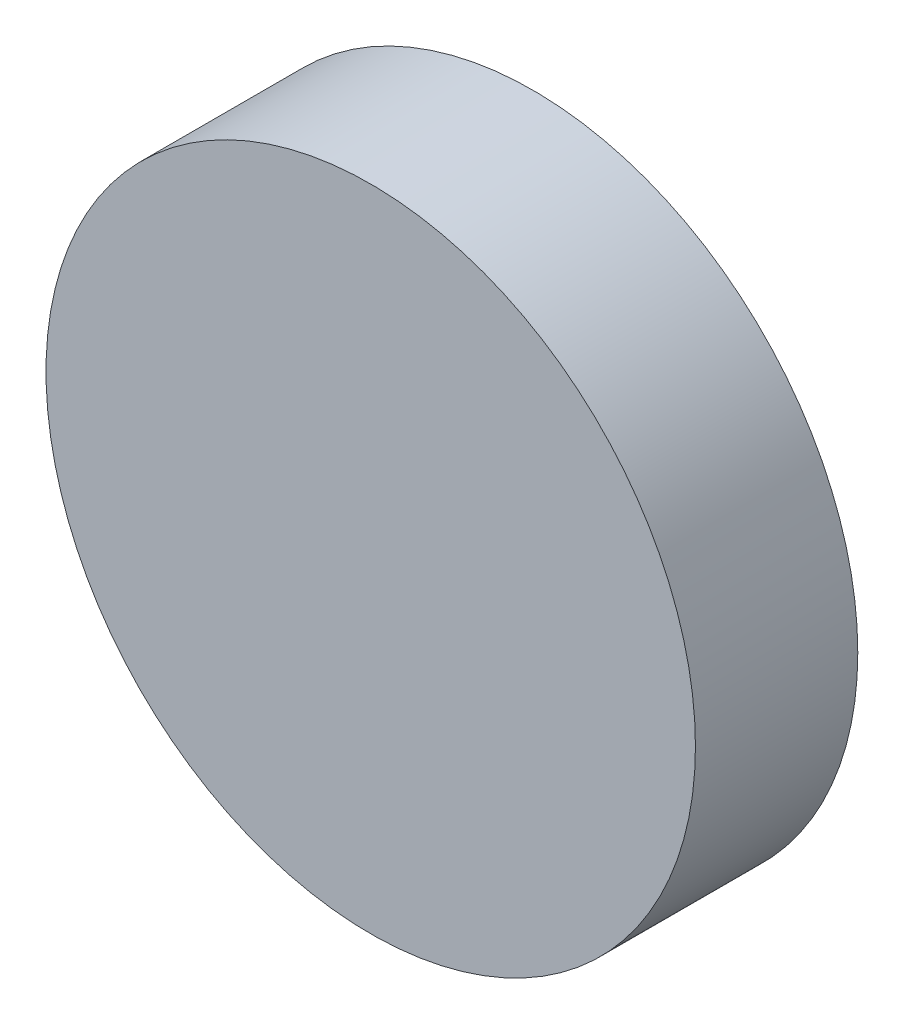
from build123d import *

# Parameters (mm, degrees)
SKIZZE1_R                       = 100
AUFSATZ_LINEAR_AUSTRAGEN1_DEPTH = 50


with BuildPart() as part:
    # Skizze1 → Aufsatz-Linear austragen1 (new body)
    with BuildSketch(Plane.XY):
        Circle(SKIZZE1_R)
    extrude(amount=AUFSATZ_LINEAR_AUSTRAGEN1_DEPTH)


solid = part.part
